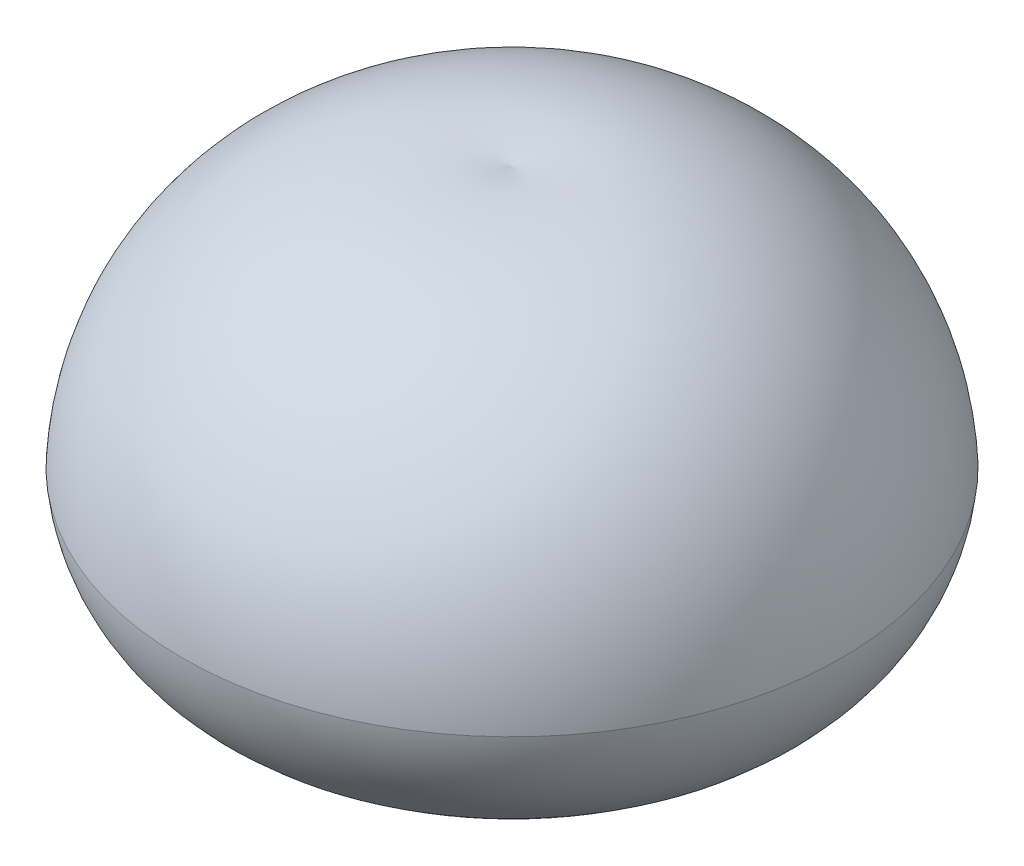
ISO-10303-21;
HEADER;
FILE_DESCRIPTION(('STEP AP214'),'2;1');
FILE_NAME('part.step','',(''),(''),'','','');
FILE_SCHEMA(('AUTOMOTIVE_DESIGN { 1 0 10303 214 1 1 1 1 }'));
ENDSEC;
DATA;
#1=APPLICATION_CONTEXT('core data for automotive mechanical design processes');
#2=APPLICATION_PROTOCOL_DEFINITION('international standard','automotive_design',2000,#1);
#3=PRODUCT_CONTEXT('',#1,'mechanical');
#4=PRODUCT('Part','Part','',(#3));
#5=PRODUCT_RELATED_PRODUCT_CATEGORY('part','',(#4));
#6=PRODUCT_DEFINITION_FORMATION('','',#4);
#7=PRODUCT_DEFINITION_CONTEXT('part definition',#1,'design');
#8=PRODUCT_DEFINITION('design','',#6,#7);
#9=PRODUCT_DEFINITION_SHAPE('','',#8);
#10=(LENGTH_UNIT() NAMED_UNIT(*) SI_UNIT(.MILLI.,.METRE.));
#11=(NAMED_UNIT(*) PLANE_ANGLE_UNIT() SI_UNIT($,.RADIAN.));
#12=(NAMED_UNIT(*) SI_UNIT($,.STERADIAN.) SOLID_ANGLE_UNIT());
#13=UNCERTAINTY_MEASURE_WITH_UNIT(LENGTH_MEASURE(1.E-05),#10,'distance_accuracy_value','');
#14=(GEOMETRIC_REPRESENTATION_CONTEXT(3) GLOBAL_UNCERTAINTY_ASSIGNED_CONTEXT((#13)) GLOBAL_UNIT_ASSIGNED_CONTEXT((#10,
#11,#12)) REPRESENTATION_CONTEXT('',''));
#15=CARTESIAN_POINT('',(0.,0.,0.));
#16=DIRECTION('',(0.,0.,1.));
#17=DIRECTION('',(1.,0.,0.));
#18=AXIS2_PLACEMENT_3D('',#15,#16,#17);
#19=CARTESIAN_POINT('',(0.,1140.,0.));
#20=DIRECTION('',(0.,-1.,0.));
#21=DIRECTION('',(0.,0.,-1.));
#22=AXIS2_PLACEMENT_3D('',#19,#20,#21);
#23=DEGENERATE_TOROIDAL_SURFACE('',#22,460.,872.80243551,.T.);
#24=CARTESIAN_POINT('',(0.,1894.89812471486,0.));
#25=DIRECTION('',(0.,-1.,0.));
#26=DIRECTION('',(0.,0.,-1.));
#27=AXIS2_PLACEMENT_3D('',#24,#25,#26);
#28=CIRCLE('',#27,898.078660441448);
#29=CARTESIAN_POINT('',(0.,1894.89812471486,-898.078660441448));
#30=VERTEX_POINT('',#29);
#31=EDGE_CURVE('E9',#30,#30,#28,.T.);
#32=ORIENTED_EDGE('',*,*,#31,.F.);
#33=EDGE_LOOP('',(#32));
#34=FACE_BOUND('',#33,.T.);
#35=CARTESIAN_POINT('',(0.,282.865692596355,0.));
#36=DIRECTION('',(0.,-1.,0.));
#37=DIRECTION('',(0.,0.,-1.));
#38=AXIS2_PLACEMENT_3D('',#35,#36,#37);
#39=CIRCLE('',#38,624.635568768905);
#40=CARTESIAN_POINT('',(0.,282.865692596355,-624.635568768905));
#41=VERTEX_POINT('',#40);
#42=EDGE_CURVE('E37',#41,#41,#39,.T.);
#43=ORIENTED_EDGE('',*,*,#42,.T.);
#44=EDGE_LOOP('',(#43));
#45=FACE_BOUND('',#44,.T.);
#46=ADVANCED_FACE('F14',(#34,#45),#23,.F.);
#47=CARTESIAN_POINT('',(0.,1411.75999736,554.2221176));
#48=DIRECTION('',(-1.,0.,0.));
#49=DIRECTION('',(0.,0.,-1.));
#50=AXIS2_PLACEMENT_3D('',#47,#48,#49);
#51=CIRCLE('',#50,1530.55545473);
#52=TRIMMED_CURVE('',#51,(PARAMETER_VALUE(-1.20027093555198)),
(PARAMETER_VALUE(1.20027093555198)),.T.,.PARAMETER.);
#53=CARTESIAN_POINT('',(0.,1411.75999736,0.));
#54=DIRECTION('',(0.,-1.,0.));
#55=AXIS1_PLACEMENT('',#53,#54);
#56=SURFACE_OF_REVOLUTION('',#52,#55);
#57=CARTESIAN_POINT('',(-2.22044604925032E-13,2838.44771524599,0.));
#58=VERTEX_POINT('',#57);
#59=VERTEX_LOOP('',#58);
#60=FACE_BOUND('',#59,.T.);
#61=ORIENTED_EDGE('',*,*,#31,.T.);
#62=EDGE_LOOP('',(#61));
#63=FACE_BOUND('',#62,.T.);
#64=ADVANCED_FACE('F27',(#60,#63),#56,.F.);
#65=CARTESIAN_POINT('',(0.,1140.,-460.));
#66=DIRECTION('',(-1.,0.,0.));
#67=DIRECTION('',(0.,0.,-1.));
#68=AXIS2_PLACEMENT_3D('',#65,#66,#67);
#69=CIRCLE('',#68,2540.42645148);
#70=TRIMMED_CURVE('',#69,(PARAMETER_VALUE(-1.75287264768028)),
(PARAMETER_VALUE(1.75287264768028)),.T.,.PARAMETER.);
#71=CARTESIAN_POINT('',(0.,1140.,0.));
#72=DIRECTION('',(0.,-1.,0.));
#73=AXIS1_PLACEMENT('',#71,#72);
#74=SURFACE_OF_REVOLUTION('',#70,#73);
#75=CARTESIAN_POINT('',(0.,1262.42469581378,0.));
#76=DIRECTION('',(0.,-1.,0.));
#77=DIRECTION('',(0.,0.,-1.));
#78=AXIS2_PLACEMENT_3D('',#75,#76,#77);
#79=CIRCLE('',#78,2997.47487657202);
#80=CARTESIAN_POINT('',(0.,1262.42469581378,-2997.47487657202));
#81=VERTEX_POINT('',#80);
#82=EDGE_CURVE('E21',#81,#81,#79,.T.);
#83=ORIENTED_EDGE('',*,*,#82,.F.);
#84=EDGE_LOOP('',(#83));
#85=FACE_BOUND('',#84,.T.);
#86=CARTESIAN_POINT('',(0.,3638.43281986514,0.));
#87=VERTEX_POINT('',#86);
#88=VERTEX_LOOP('',#87);
#89=FACE_BOUND('',#88,.T.);
#90=ADVANCED_FACE('F30',(#85,#89),#74,.T.);
#91=CARTESIAN_POINT('',(0.,1411.75999736,0.));
#92=DIRECTION('',(0.,-1.,0.));
#93=DIRECTION('',(0.,0.,-1.));
#94=AXIS2_PLACEMENT_3D('',#91,#92,#93);
#95=DEGENERATE_TOROIDAL_SURFACE('',#94,1474.2221176,1530.55545473,.T.);
#96=CARTESIAN_POINT('',(0.,94.3359858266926,0.));
#97=DIRECTION('',(0.,-1.,0.));
#98=DIRECTION('',(0.,0.,-1.));
#99=AXIS2_PLACEMENT_3D('',#96,#97,#98);
#100=CIRCLE('',#99,695.123937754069);
#101=CARTESIAN_POINT('',(0.,94.3359858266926,-695.123937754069));
#102=VERTEX_POINT('',#101);
#103=EDGE_CURVE('E39',#102,#102,#100,.T.);
#104=ORIENTED_EDGE('',*,*,#103,.F.);
#105=EDGE_LOOP('',(#104));
#106=FACE_BOUND('',#105,.T.);
#107=ORIENTED_EDGE('',*,*,#82,.T.);
#108=EDGE_LOOP('',(#107));
#109=FACE_BOUND('',#108,.T.);
#110=ADVANCED_FACE('F46',(#106,#109),#95,.T.);
#111=CARTESIAN_POINT('',(0.,-934.10128129,0.));
#112=DIRECTION('',(0.,-1.,0.));
#113=DIRECTION('',(0.,0.,-1.));
#114=AXIS2_PLACEMENT_3D('',#111,#112,#113);
#115=DEGENERATE_TOROIDAL_SURFACE('',#114,2342.92346967,3207.40007828,.F.);
#116=ORIENTED_EDGE('',*,*,#42,.F.);
#117=EDGE_LOOP('',(#116));
#118=FACE_BOUND('',#117,.T.);
#119=ORIENTED_EDGE('',*,*,#103,.T.);
#120=EDGE_LOOP('',(#119));
#121=FACE_BOUND('',#120,.T.);
#122=ADVANCED_FACE('F55',(#118,#121),#115,.T.);
#123=CLOSED_SHELL('',(#46,#64,#90,#110,#122));
#124=MANIFOLD_SOLID_BREP('B1',#123);
#125=ADVANCED_BREP_SHAPE_REPRESENTATION('',(#18,#124),#14);
#126=SHAPE_DEFINITION_REPRESENTATION(#9,#125);
ENDSEC;
END-ISO-10303-21;
